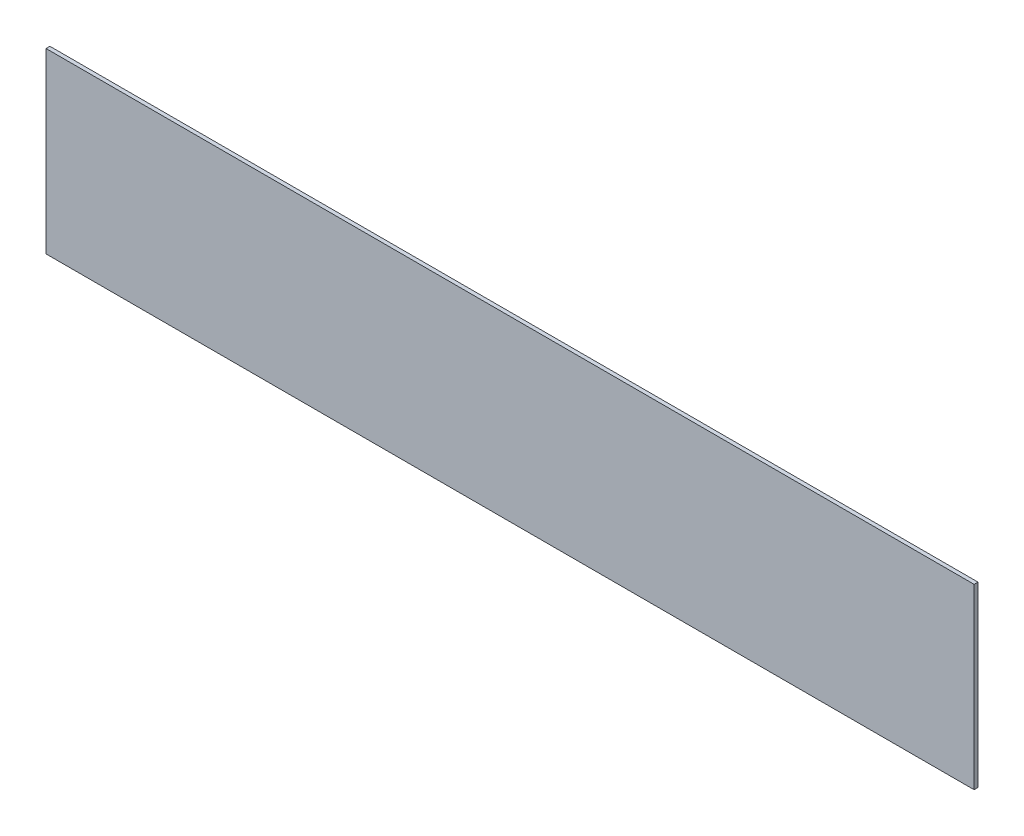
from build123d import *

# Parameters (mm, degrees)
ESQUISSE1_W             = 120
ESQUISSE1_H             = 23
BOSS_EXTRU_1_DEPTH      = 0.5
ESQUISSE3_W             = 0.889033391
ESQUISSE3_H             = 4.622973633
ENL_V_MAT_EXTRU_1_DEPTH = 0.3


with BuildPart() as part:
    # Esquisse1 → Boss.-Extru.1 (new body)
    with BuildSketch(Plane(origin=(0, 0, 0), x_dir=(-1, 0, 0), z_dir=(0, 0, -1))):
        with Locations((-60, -11.5)):
            Rectangle(ESQUISSE1_W, ESQUISSE1_H)
    extrude(amount=-BOSS_EXTRU_1_DEPTH)

    # Esquisse3 → Enl_v. mat.-Extru.1 (cut)
    # profile 1 of 15: a face of its own
    with BuildSketch(Plane(origin=(0, 0, 0), x_dir=(-1, 0, 0), z_dir=(0, 0, -1))):
        with BuildLine():
            Line((-107.200895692, -6.103883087), (-106.311862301, -6.400227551))
            add(Edge.make_bspline(
                [(-106.311862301, -6.400227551), (-106.329930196, -6.458519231), (-106.365312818, -6.572672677), (-106.430281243, -6.736281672), (-106.50457163, -6.887905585), (-106.585512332, -7.029319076), (-106.678136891, -7.156868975), (-106.777259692, -7.274778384), (-106.885828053, -7.380563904), (-107.003306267, -7.474451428), (-107.128563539, -7.557478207), (-107.263054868, -7.627668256), (-107.404773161, -7.688121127), (-107.55515552, -7.737100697), (-107.713203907, -7.776325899), (-107.879659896, -7.802234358), (-108.053744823, -7.819801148), (-108.172612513, -7.821705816), (-108.233470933, -7.822680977)],
                knots=[0, 0, 0, 0, 1.126640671, 2.206316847, 3.246446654, 4.24268115, 5.210795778, 6.153057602, 7.084219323, 8.004711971, 8.926421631, 9.854560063, 10.802134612, 11.768317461, 12.772025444, 13.805668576, 14.876536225, 16, 16, 16, 16], degree=3))
            add(Edge.make_bspline(
                [(-108.233470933, -7.822680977), (-108.308588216, -7.821127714), (-108.456346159, -7.8180724), (-108.672428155, -7.787316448), (-108.878344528, -7.739329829), (-109.074389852, -7.67289319), (-109.259255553, -7.58489803), (-109.434628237, -7.478963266), (-109.599231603, -7.352938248), (-109.752488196, -7.208946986), (-109.891725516, -7.048088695), (-110.012129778, -6.871232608), (-110.115011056, -6.680870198), (-110.198165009, -6.476093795), (-110.263185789, -6.257113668), (-110.308732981, -6.024232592), (-110.337233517, -5.77737721), (-110.34048056, -5.608203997), (-110.342147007, -5.521381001)],
                knots=[0, 0, 0, 0, 1.025049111, 2.016302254, 2.973197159, 3.90886983, 4.83646737, 5.763135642, 6.70136783, 7.661478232, 8.629732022, 9.600038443, 10.576877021, 11.5787097, 12.612181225, 13.690866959, 14.814907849, 16, 16, 16, 16], degree=3))
            add(Edge.make_bspline(
                [(-110.342147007, -5.521381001), (-110.340488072, -5.429928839), (-110.337251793, -5.251522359), (-110.308697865, -4.992134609), (-110.264369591, -4.747676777), (-110.199238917, -4.519664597), (-110.117306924, -4.3064934), (-110.014300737, -4.110279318), (-109.895097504, -3.928406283), (-109.75649211, -3.764207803), (-109.602537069, -3.618421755), (-109.4375552, -3.489507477), (-109.260007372, -3.38135764), (-109.070865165, -3.292918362), (-108.869874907, -3.224479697), (-108.657432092, -3.175198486), (-108.433362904, -3.146513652), (-108.280165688, -3.142491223), (-108.201984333, -3.140438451)],
                knots=[0, 0, 0, 0, 1.212648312, 2.365655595, 3.457000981, 4.504219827, 5.506356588, 6.480637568, 7.437950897, 8.385265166, 9.323599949, 10.245787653, 11.157260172, 12.074946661, 13.00980897, 13.968233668, 14.963125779, 16, 16, 16, 16], degree=3))
            add(Edge.make_bspline(
                [(-108.201984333, -3.140438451), (-108.133705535, -3.1421589), (-107.999835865, -3.145532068), (-107.803797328, -3.168449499), (-107.618007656, -3.208668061), (-107.441462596, -3.262954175), (-107.27516714, -3.334597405), (-107.11882337, -3.422144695), (-106.971893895, -3.525132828), (-106.883365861, -3.605578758), (-106.838799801, -3.646076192)],
                knots=[0, 0, 0, 0, 1.098510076, 2.153775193, 3.169777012, 4.153122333, 5.120892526, 6.076995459, 7.031936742, 8, 8, 8, 8], degree=3))
            add(Edge.make_bspline(
                [(-106.838799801, -3.646076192), (-106.812969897, -3.671845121), (-106.760703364, -3.723988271), (-106.690912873, -3.812020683), (-106.624742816, -3.90678759), (-106.563243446, -4.009905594), (-106.508358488, -4.122153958), (-106.457446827, -4.241808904), (-106.41057437, -4.369331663), (-106.384507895, -4.458079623), (-106.371131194, -4.503622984)],
                knots=[0, 0, 0, 0, 0.885292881, 1.791380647, 2.722937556, 3.69093542, 4.703306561, 5.754477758, 6.847650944, 8, 8, 8, 8], degree=3))
            Line((-106.371131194, -4.503622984), (-107.260164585, -4.681429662))
            add(Edge.make_bspline(
                [(-107.260164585, -4.681429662), (-107.267721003, -4.652269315), (-107.282605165, -4.594831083), (-107.31272124, -4.512295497), (-107.347266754, -4.433976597), (-107.390082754, -4.361792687), (-107.435564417, -4.292532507), (-107.489412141, -4.229271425), (-107.548187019, -4.170351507), (-107.612312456, -4.116384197), (-107.681023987, -4.068459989), (-107.752998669, -4.02537911), (-107.829544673, -3.990211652), (-107.909643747, -3.961761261), (-107.992976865, -3.937907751), (-108.080285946, -3.923172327), (-108.170821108, -3.911860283), (-108.232505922, -3.911247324), (-108.264031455, -3.910934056)],
                knots=[0, 0, 0, 0, 1.051226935, 2.070641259, 3.064374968, 4.034983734, 4.997599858, 5.953980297, 6.92954377, 7.901109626, 8.875958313, 9.851998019, 10.826131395, 11.811470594, 12.818270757, 13.847890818, 14.900111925, 16, 16, 16, 16], degree=3))
            add(Edge.make_bspline(
                [(-108.264031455, -3.910934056), (-108.30732593, -3.911808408), (-108.391823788, -3.913514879), (-108.515330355, -3.932540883), (-108.633046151, -3.959093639), (-108.744496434, -3.999639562), (-108.848991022, -4.051497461), (-108.947717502, -4.114536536), (-109.04013401, -4.188486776), (-109.126271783, -4.274224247), (-109.203568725, -4.373299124), (-109.271523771, -4.485915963), (-109.327898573, -4.613353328), (-109.373665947, -4.754360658), (-109.409690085, -4.909273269), (-109.435414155, -5.078289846), (-109.449640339, -5.261526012), (-109.451930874, -5.388310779), (-109.453113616, -5.45377742)],
                knots=[0, 0, 0, 0, 0.938194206, 1.831074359, 2.704771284, 3.551924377, 4.396294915, 5.230222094, 6.087631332, 6.958733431, 7.860107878, 8.806247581, 9.804197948, 10.875520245, 12.017191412, 13.250061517, 14.580040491, 16, 16, 16, 16], degree=3))
            add(Edge.make_bspline(
                [(-109.453113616, -5.45377742), (-109.45194252, -5.523255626), (-109.449685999, -5.657129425), (-109.435462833, -5.850229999), (-109.40957427, -6.027831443), (-109.374028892, -6.190248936), (-109.32803088, -6.337382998), (-109.271751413, -6.468979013), (-109.204845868, -6.585191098), (-109.127418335, -6.685941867), (-109.041426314, -6.772486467), (-108.949198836, -6.846895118), (-108.851280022, -6.910514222), (-108.747080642, -6.962855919), (-108.636204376, -7.00245183), (-108.519562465, -7.031167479), (-108.39672693, -7.049422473), (-108.312561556, -7.051251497), (-108.269587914, -7.052185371)],
                knots=[0, 0, 0, 0, 1.475208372, 2.842499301, 4.107722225, 5.282836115, 6.369007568, 7.375918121, 8.315702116, 9.208439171, 10.065831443, 10.90006451, 11.71996243, 12.54067204, 13.369972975, 14.214060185, 15.088124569, 16, 16, 16, 16], degree=3))
            add(Edge.make_bspline(
                [(-108.269587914, -7.052185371), (-108.237771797, -7.051391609), (-108.175210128, -7.049830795), (-108.082739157, -7.039924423), (-107.993985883, -7.02101954), (-107.908515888, -6.996021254), (-107.825997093, -6.96465578), (-107.74768818, -6.924420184), (-107.672048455, -6.878175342), (-107.600647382, -6.82397993), (-107.532528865, -6.763135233), (-107.470400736, -6.692813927), (-107.412771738, -6.614705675), (-107.360372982, -6.528288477), (-107.311453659, -6.434302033), (-107.26983285, -6.331281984), (-107.231059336, -6.220893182), (-107.211125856, -6.143567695), (-107.200895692, -6.103883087)],
                knots=[0, 0, 0, 0, 0.980177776, 1.927374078, 2.859849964, 3.771585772, 4.668674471, 5.574490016, 6.479656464, 7.396337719, 8.332153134, 9.288470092, 10.28125149, 11.318486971, 12.398724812, 13.541284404, 14.738150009, 16, 16, 16, 16], degree=3))
        make_face()
    # profile 2 of 15: a face of its own
    with BuildSketch(Plane(origin=(0, 0, 0), x_dir=(-1, 0, 0), z_dir=(0, 0, -1))):
        Polygon((-105.541366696, -7.822680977), (-105.541366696, -3.199707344), (-104.652333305, -3.199707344), (-104.652333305, -5.037043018), (-102.755728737, -5.037043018), (-102.755728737, -3.199707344), (-101.866695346, -3.199707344), (-101.866695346, -7.822680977), (-102.755728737, -7.822680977), (-102.755728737, -5.807538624), (-104.652333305, -5.807538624), (-104.652333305, -7.822680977), align=None)
    # profile 3 of 15: a face of its own
    with BuildSketch(Plane(origin=(0, 0, 0), x_dir=(-1, 0, 0), z_dir=(0, 0, -1))):
        Polygon((-96.94737725, -7.822680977), (-97.890123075, -7.822680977), (-98.28000126, -6.755840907), (-100.054363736, -6.755840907), (-100.444241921, -7.822680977), (-101.392544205, -7.822680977), (-99.645037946, -3.199707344), (-98.703218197, -3.199707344), align=None)
        Polygon((-98.562454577, -5.985345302), (-99.169960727, -4.325816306), (-99.775614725, -5.985345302), align=None, mode=Mode.SUBTRACT)
    # profile 4 of 15: a face of its own
    with BuildSketch(Plane(origin=(0, 0, 0), x_dir=(-1, 0, 0), z_dir=(0, 0, -1))):
        with BuildLine():
            Line((-96.473226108, -7.822680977), (-96.473226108, -3.199707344))
            Line((-96.473226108, -3.199707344), (-94.533095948, -3.199707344))
            add(Edge.make_bspline(
                [(-94.533095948, -3.199707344), (-94.474133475, -3.200070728), (-94.360501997, -3.200771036), (-94.196168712, -3.205877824), (-94.044616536, -3.216576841), (-93.90517318, -3.228693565), (-93.778508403, -3.246322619), (-93.664121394, -3.267442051), (-93.562204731, -3.291916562), (-93.471271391, -3.321228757), (-93.388358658, -3.354777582), (-93.311121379, -3.394710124), (-93.238710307, -3.441496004), (-93.17001328, -3.493522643), (-93.104739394, -3.55086998), (-93.044678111, -3.61505571), (-92.988783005, -3.685124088), (-92.937099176, -3.760492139), (-92.891568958, -3.840827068), (-92.849966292, -3.923548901), (-92.816100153, -4.009537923), (-92.78812703, -4.098389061), (-92.765781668, -4.189909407), (-92.750272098, -4.28433164), (-92.740589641, -4.381484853), (-92.739725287, -4.447109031), (-92.739285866, -4.480471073)],
                knots=[0, 0, 0, 0, 1.675828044, 3.229627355, 4.67171229, 5.993455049, 7.206927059, 8.304770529, 9.29850117, 10.183580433, 11.017754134, 11.837875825, 12.650738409, 13.464925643, 14.285328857, 15.117007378, 15.959673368, 16.830859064, 17.711229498, 18.58228265, 19.460420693, 20.334473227, 21.228207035, 22.135446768, 23.052097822, 24, 24, 24, 24], degree=3))
            add(Edge.make_bspline(
                [(-92.739285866, -4.480471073), (-92.740100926, -4.522497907), (-92.741693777, -4.604629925), (-92.756352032, -4.725009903), (-92.778123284, -4.840024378), (-92.809158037, -4.949832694), (-92.85183019, -5.053143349), (-92.901367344, -5.151403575), (-92.960448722, -5.244280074), (-93.02867293, -5.330852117), (-93.10597889, -5.411196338), (-93.192705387, -5.483659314), (-93.288233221, -5.548524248), (-93.393140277, -5.605417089), (-93.506696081, -5.654054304), (-93.629393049, -5.694976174), (-93.760675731, -5.728282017), (-93.851995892, -5.743953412), (-93.89873358, -5.751974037)],
                knots=[0, 0, 0, 0, 1.05911256, 2.069797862, 3.05271628, 4.008392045, 4.940519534, 5.866323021, 6.779546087, 7.71056835, 8.640711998, 9.585328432, 10.554502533, 11.547017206, 12.589327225, 13.664782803, 14.804835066, 16, 16, 16, 16], degree=3))
            add(Edge.make_bspline(
                [(-93.89873358, -5.751974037), (-93.853532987, -5.781910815), (-93.765069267, -5.840501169), (-93.642673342, -5.937000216), (-93.532790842, -6.038283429), (-93.449593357, -6.128350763), (-93.385664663, -6.207555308), (-93.334191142, -6.276828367), (-93.278668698, -6.356551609), (-93.219641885, -6.44676823), (-93.15536572, -6.546680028), (-93.08823075, -6.657816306), (-93.016832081, -6.779093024), (-92.968827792, -6.863810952), (-92.943948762, -6.907717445)],
                knots=[0, 0, 0, 0, 1.285445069, 2.515791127, 3.691898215, 4.826622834, 5.420063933, 6.105349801, 6.873086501, 7.723915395, 8.66222816, 9.690593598, 10.803111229, 12, 12, 12, 12], degree=3))
            Line((-92.943948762, -6.907717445), (-92.38367251, -7.822680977))
            Line((-92.38367251, -7.822680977), (-93.422730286, -7.822680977))
            Line((-93.422730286, -7.822680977), (-94.080244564, -6.77343636))
            add(Edge.make_bspline(
                [(-94.080244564, -6.77343636), (-94.11044154, -6.73141487), (-94.168093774, -6.651187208), (-94.251318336, -6.537181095), (-94.327461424, -6.435695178), (-94.394496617, -6.345259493), (-94.455815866, -6.268438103), (-94.509557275, -6.203892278), (-94.554626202, -6.150236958), (-94.605621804, -6.097035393), (-94.664949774, -6.042359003), (-94.738393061, -5.98934713), (-94.813812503, -5.947086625), (-94.894618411, -5.914840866), (-94.988068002, -5.892356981), (-95.10040921, -5.878031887), (-95.235174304, -5.867462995), (-95.332582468, -5.867037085), (-95.385086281, -5.866807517)],
                knots=[0, 0, 0, 0, 1.465447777, 2.797841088, 3.997266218, 5.05856206, 5.985598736, 6.780315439, 7.437430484, 7.969193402, 8.866571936, 9.718200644, 10.52825214, 11.309096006, 12.174169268, 13.242355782, 14.513606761, 16, 16, 16, 16], degree=3))
            Line((-95.385086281, -5.866807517), (-95.584192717, -5.866807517))
            Line((-95.584192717, -5.866807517), (-95.584192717, -7.822680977))
            Line((-95.584192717, -7.822680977), (-96.473226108, -7.822680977))
        make_face()
        with BuildLine():
            Line((-95.584192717, -5.096311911), (-94.868335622, -5.096311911))
            add(Edge.make_bspline(
                [(-94.868335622, -5.096311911), (-94.81307706, -5.096193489), (-94.70780016, -5.095967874), (-94.558094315, -5.092699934), (-94.424356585, -5.089926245), (-94.307387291, -5.082957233), (-94.206663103, -5.076050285), (-94.122588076, -5.067073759), (-94.054453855, -5.056463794), (-93.98639922, -5.039968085), (-93.91668815, -5.011227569), (-93.842389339, -4.970292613), (-93.778887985, -4.917188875), (-93.723881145, -4.855795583), (-93.681918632, -4.783622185), (-93.649052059, -4.703884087), (-93.632388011, -4.614809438), (-93.629703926, -4.553069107), (-93.628319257, -4.521218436)],
                knots=[0, 0, 0, 0, 1.697953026, 3.23488743, 4.60134403, 5.807846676, 6.835100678, 7.703488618, 8.405232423, 8.952775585, 9.851109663, 10.713519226, 11.549115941, 12.382556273, 13.233359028, 14.101746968, 15.020727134, 16, 16, 16, 16], degree=3))
            add(Edge.make_bspline(
                [(-93.628319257, -4.521218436), (-93.629894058, -4.485586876), (-93.632932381, -4.416841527), (-93.65689303, -4.31901624), (-93.698715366, -4.232601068), (-93.756153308, -4.157453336), (-93.828257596, -4.093997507), (-93.914141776, -4.043627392), (-94.01316779, -4.006113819), (-94.084591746, -3.99226013), (-94.121918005, -3.985020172)],
                knots=[0, 0, 0, 0, 1.062977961, 2.050844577, 2.982300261, 3.90936959, 4.856017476, 5.831122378, 6.86654153, 8, 8, 8, 8], degree=3))
            add(Edge.make_bspline(
                [(-94.121918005, -3.985020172), (-94.134256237, -3.983664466), (-94.163500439, -3.980451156), (-94.215142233, -3.978387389), (-94.281172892, -3.975215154), (-94.362391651, -3.973918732), (-94.458072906, -3.971646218), (-94.568597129, -3.971228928), (-94.693613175, -3.969895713), (-94.781901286, -3.970096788), (-94.828514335, -3.970202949)],
                knots=[0, 0, 0, 0, 0.42127143, 0.998501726, 1.753681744, 2.66564073, 3.755712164, 5.002818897, 6.417592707, 8, 8, 8, 8], degree=3))
            Line((-94.828514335, -3.970202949), (-95.584192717, -3.970202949))
            Line((-95.584192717, -3.970202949), (-95.584192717, -5.096311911))
        make_face(mode=Mode.SUBTRACT)
    # profile 5 of 15: a face of its own
    with BuildSketch(Plane(origin=(0, 0, 0), x_dir=(-1, 0, 0), z_dir=(0, 0, -1))):
        with BuildLine():
            Line((-89.77584123, -6.103883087), (-89.77584123, -5.333387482))
            Line((-89.77584123, -5.333387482), (-87.760698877, -5.333387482))
            Line((-87.760698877, -5.333387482), (-87.760698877, -7.190170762))
            add(Edge.make_bspline(
                [(-87.760698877, -7.190170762), (-87.786059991, -7.213009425), (-87.837903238, -7.259696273), (-87.922502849, -7.325516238), (-88.015589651, -7.388440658), (-88.116972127, -7.449379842), (-88.22575307, -7.509524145), (-88.342813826, -7.567158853), (-88.468452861, -7.621222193), (-88.644338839, -7.693001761), (-88.872387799, -7.767803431), (-89.15039573, -7.834054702), (-89.430773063, -7.874400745), (-89.618280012, -7.879435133), (-89.711941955, -7.881949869)],
                knots=[0, 0, 0, 0, 0.58168568, 1.189083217, 1.825470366, 2.496035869, 3.204984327, 3.943979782, 4.719294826, 5.536247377, 7.182083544, 8.80443077, 10.4037753, 12, 12, 12, 12], degree=3))
            add(Edge.make_bspline(
                [(-89.711941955, -7.881949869), (-89.770619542, -7.881068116), (-89.886290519, -7.879329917), (-90.057047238, -7.865339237), (-90.221896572, -7.84140125), (-90.38097286, -7.807503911), (-90.534814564, -7.766641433), (-90.682780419, -7.714515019), (-90.824345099, -7.651941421), (-90.960791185, -7.58221607), (-91.08957499, -7.502130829), (-91.210820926, -7.414524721), (-91.323651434, -7.318635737), (-91.427662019, -7.214270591), (-91.52424554, -7.102148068), (-91.612275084, -6.981733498), (-91.691218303, -6.852887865), (-91.762049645, -6.717227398), (-91.825064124, -6.575945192), (-91.878237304, -6.430153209), (-91.924854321, -6.28196819), (-91.963168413, -6.130869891), (-91.99130824, -5.976367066), (-92.013183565, -5.81917459), (-92.024932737, -5.658310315), (-92.027009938, -5.550105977), (-92.028059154, -5.495450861)],
                knots=[0, 0, 0, 0, 1.124918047, 2.217548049, 3.282233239, 4.316494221, 5.334437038, 6.332151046, 7.320712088, 8.300141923, 9.267552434, 10.225301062, 11.165776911, 12.103230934, 13.047553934, 14.000517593, 14.959782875, 15.941944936, 16.932894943, 17.923491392, 18.915624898, 19.910402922, 20.909870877, 21.92519501, 22.95199481, 24, 24, 24, 24], degree=3))
            add(Edge.make_bspline(
                [(-92.028059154, -5.495450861), (-92.027208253, -5.436460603), (-92.02553076, -5.320165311), (-92.011073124, -5.148282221), (-91.988622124, -4.981435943), (-91.954576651, -4.819929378), (-91.913156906, -4.663010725), (-91.862606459, -4.510783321), (-91.800671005, -4.364375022), (-91.731773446, -4.222533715), (-91.65334279, -4.08722092), (-91.56472056, -3.960172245), (-91.468529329, -3.840106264), (-91.36286828, -3.728930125), (-91.2481095, -3.626698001), (-91.125419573, -3.532279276), (-90.995092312, -3.444046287), (-90.901813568, -3.394296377), (-90.854720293, -3.369179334)],
                knots=[0, 0, 0, 0, 1.105010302, 2.178452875, 3.229459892, 4.257086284, 5.268538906, 6.268935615, 7.259234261, 8.24469117, 9.221745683, 10.185929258, 11.144249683, 12.101504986, 13.055838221, 14.020611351, 15.000673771, 16, 16, 16, 16], degree=3))
            add(Edge.make_bspline(
                [(-90.854720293, -3.369179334), (-90.817346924, -3.350622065), (-90.741438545, -3.31293073), (-90.620667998, -3.267929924), (-90.494358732, -3.226983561), (-90.360603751, -3.196432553), (-90.220311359, -3.171332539), (-90.07354373, -3.152601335), (-89.919828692, -3.142764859), (-89.815366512, -3.141225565), (-89.761950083, -3.140438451)],
                knots=[0, 0, 0, 0, 0.887969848, 1.803539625, 2.741143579, 3.713741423, 4.722068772, 5.775476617, 6.8624965, 8, 8, 8, 8], degree=3))
            add(Edge.make_bspline(
                [(-89.761950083, -3.140438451), (-89.693079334, -3.141464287), (-89.55913846, -3.143459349), (-89.363862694, -3.160083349), (-89.18008268, -3.188734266), (-89.007542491, -3.228194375), (-88.846613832, -3.278929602), (-88.697573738, -3.341302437), (-88.559507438, -3.414057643), (-88.434414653, -3.500111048), (-88.319753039, -3.594994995), (-88.215821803, -3.698824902), (-88.122579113, -3.81175456), (-88.039963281, -3.933215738), (-87.968624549, -4.063710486), (-87.907286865, -4.202048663), (-87.856798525, -4.349280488), (-87.83239863, -4.451530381), (-87.81996777, -4.503622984)],
                knots=[0, 0, 0, 0, 1.271135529, 2.472123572, 3.614091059, 4.701890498, 5.736279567, 6.724681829, 7.680621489, 8.611506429, 9.52200816, 10.424540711, 11.318996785, 12.221421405, 13.131851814, 14.060431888, 15.011860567, 16, 16, 16, 16], degree=3))
            Line((-87.81996777, -4.503622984), (-88.709001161, -4.681429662))
            add(Edge.make_bspline(
                [(-88.709001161, -4.681429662), (-88.717804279, -4.652256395), (-88.735172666, -4.594698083), (-88.768842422, -4.512076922), (-88.807622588, -4.434407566), (-88.851606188, -4.361127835), (-88.901236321, -4.292688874), (-88.957712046, -4.229828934), (-89.017480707, -4.169680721), (-89.084445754, -4.116430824), (-89.155825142, -4.068426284), (-89.230814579, -4.025138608), (-89.311108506, -3.99003351), (-89.395582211, -3.96178764), (-89.483822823, -3.937799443), (-89.576981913, -3.923046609), (-89.674013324, -3.911920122), (-89.740306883, -3.911266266), (-89.773989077, -3.910934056)],
                knots=[0, 0, 0, 0, 1.027736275, 2.027704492, 3.005900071, 3.954421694, 4.908588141, 5.853155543, 6.803277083, 7.766271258, 8.734041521, 9.704274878, 10.683578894, 11.68490234, 12.708089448, 13.76461009, 14.864251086, 16, 16, 16, 16], degree=3))
            add(Edge.make_bspline(
                [(-89.773989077, -3.910934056), (-89.824968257, -3.912294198), (-89.924458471, -3.914948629), (-90.069700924, -3.932269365), (-90.206723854, -3.963084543), (-90.335885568, -4.005588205), (-90.457422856, -4.060144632), (-90.569693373, -4.128788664), (-90.675492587, -4.207458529), (-90.771809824, -4.299790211), (-90.859158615, -4.403320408), (-90.934774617, -4.519284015), (-90.997724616, -4.647306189), (-91.049284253, -4.786744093), (-91.090336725, -4.937603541), (-91.118186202, -5.100418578), (-91.136382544, -5.274939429), (-91.138126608, -5.395385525), (-91.139025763, -5.457481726)],
                knots=[0, 0, 0, 0, 1.043810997, 2.037086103, 2.989314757, 3.91471467, 4.817033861, 5.710208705, 6.603920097, 7.511448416, 8.435617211, 9.371747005, 10.338444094, 11.350425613, 12.411431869, 13.5347293, 14.729025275, 16, 16, 16, 16], degree=3))
            add(Edge.make_bspline(
                [(-91.139025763, -5.457481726), (-91.138088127, -5.524199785), (-91.136265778, -5.653870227), (-91.118546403, -5.841754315), (-91.089397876, -6.016802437), (-91.047589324, -6.178793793), (-90.994981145, -6.328303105), (-90.931743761, -6.465807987), (-90.853701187, -6.588756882), (-90.765792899, -6.699614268), (-90.667538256, -6.796480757), (-90.561692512, -6.880931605), (-90.448844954, -6.952500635), (-90.327954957, -7.010058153), (-90.200547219, -7.05587542), (-90.065450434, -7.087996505), (-89.923066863, -7.10794894), (-89.825607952, -7.110269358), (-89.77584123, -7.111454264)],
                knots=[0, 0, 0, 0, 1.318042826, 2.561693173, 3.724929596, 4.821196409, 5.862977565, 6.853497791, 7.804600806, 8.73339865, 9.643480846, 10.524649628, 11.404635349, 12.277659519, 13.165160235, 14.075017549, 15.017020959, 16, 16, 16, 16], degree=3))
            add(Edge.make_bspline(
                [(-89.77584123, -7.111454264), (-89.725434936, -7.110053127), (-89.624140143, -7.107237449), (-89.472419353, -7.08337743), (-89.320104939, -7.048266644), (-89.170771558, -6.995301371), (-89.025743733, -6.934550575), (-88.890344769, -6.864536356), (-88.763547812, -6.791555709), (-88.687201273, -6.734674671), (-88.649732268, -6.706758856)],
                knots=[0, 0, 0, 0, 0.993821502, 1.997150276, 3.023717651, 4.073291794, 5.118404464, 6.123376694, 7.078999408, 8, 8, 8, 8], degree=3))
            Line((-88.649732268, -6.706758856), (-88.649732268, -6.103883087))
            Line((-88.649732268, -6.103883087), (-89.77584123, -6.103883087))
        make_face()
    # profile 6 of 15: a face of its own
    with BuildSketch(Plane(origin=(0, 0, 0), x_dir=(-1, 0, 0), z_dir=(0, 0, -1))):
        Polygon((-86.871665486, -7.822680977), (-86.871665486, -3.199707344), (-83.434069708, -3.199707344), (-83.434069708, -3.970202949), (-85.982632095, -3.970202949), (-85.982632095, -4.977774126), (-83.611876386, -4.977774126), (-83.611876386, -5.748269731), (-85.982632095, -5.748269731), (-85.982632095, -7.052185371), (-83.374800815, -7.052185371), (-83.374800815, -7.822680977), align=None)
    # profile 7 of 15: a face of its own
    with BuildSketch(Plane(origin=(0, 0, 0), x_dir=(-1, 0, 0), z_dir=(0, 0, -1))):
        Polygon((-104.074649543, -18.191514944), (-104.074649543, -13.568541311), (-102.57070139, -13.568541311), (-101.792797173, -16.72183162), (-101.014892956, -13.568541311), (-99.510944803, -13.568541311), (-99.510944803, -18.191514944), (-100.399978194, -18.191514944), (-100.42961264, -14.5520345), (-101.297346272, -18.191514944), (-102.288248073, -18.191514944), (-103.155981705, -14.5520345), (-103.185616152, -18.191514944), align=None)
    # profile 8 of 15: a face of its own
    with BuildSketch(Plane(origin=(0, 0, 0), x_dir=(-1, 0, 0), z_dir=(0, 0, -1))):
        Polygon((-94.650895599, -18.191514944), (-95.593641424, -18.191514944), (-95.983519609, -17.124674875), (-97.757882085, -17.124674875), (-98.14776027, -18.191514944), (-99.096062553, -18.191514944), (-97.348556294, -13.568541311), (-96.406736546, -13.568541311), align=None)
        Polygon((-96.265972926, -16.35417927), (-96.873479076, -14.694650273), (-97.479133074, -16.35417927), align=None, mode=Mode.SUBTRACT)
    # profile 9 of 15: a face of its own
    with BuildSketch(Plane(origin=(0, 0, 0), x_dir=(-1, 0, 0), z_dir=(0, 0, -1))):
        Polygon((-94.621261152, -18.191514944), (-93.036744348, -15.742968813), (-94.443454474, -13.568541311), (-93.404396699, -13.568541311), (-92.517215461, -14.940060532), (-91.630034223, -13.568541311), (-90.590976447, -13.568541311), (-91.997686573, -15.742968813), (-90.413169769, -18.191514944), (-91.452227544, -18.191514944), (-92.517215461, -16.545877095), (-93.582203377, -18.191514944), align=None)
    # profile 10 of 15: a face of its own
    with BuildSketch(Plane(origin=(0, 0, 0), x_dir=(-1, 0, 0), z_dir=(0, 0, -1))):
        with Locations((-89.524136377, -15.880028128)):
            Rectangle(ESQUISSE3_W, ESQUISSE3_H)
    # profile 11 of 15: a face of its own
    with BuildSketch(Plane(origin=(0, 0, 0), x_dir=(-1, 0, 0), z_dir=(0, 0, -1))):
        with BuildLine():
            Line((-60.354818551, -17.106404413), (-62.72557426, -17.106404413))
            Line((-62.72557426, -17.106404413), (-62.72557426, -8.329669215))
            add(Edge.make_bspline(
                [(-62.72557426, -8.329669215), (-62.833029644, -8.438756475), (-63.046482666, -8.655451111), (-63.387400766, -8.957711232), (-63.741325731, -9.238892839), (-64.111759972, -9.496325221), (-64.493860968, -9.733676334), (-64.891533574, -9.949073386), (-65.301895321, -10.145496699), (-65.586170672, -10.255266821), (-65.728531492, -10.310238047)],
                knots=[0, 0, 0, 0, 1.012567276, 2.011397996, 3.011400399, 4.000747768, 4.993445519, 5.985067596, 6.990952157, 8, 8, 8, 8], degree=3))
            Line((-65.728531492, -10.310238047), (-65.728531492, -7.939482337))
            add(Edge.make_bspline(
                [(-65.728531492, -7.939482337), (-65.570646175, -7.880282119), (-65.240204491, -7.756380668), (-64.75258369, -7.492836), (-64.243617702, -7.166541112), (-63.816057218, -6.846521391), (-63.47659177, -6.561998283), (-63.23933123, -6.33328635), (-63.019495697, -6.099073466), (-62.825348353, -5.851800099), (-62.651792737, -5.59646557), (-62.498014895, -5.333487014), (-62.362655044, -5.062033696), (-62.291795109, -4.872999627), (-62.256362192, -4.778474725)],
                knots=[0, 0, 0, 0, 1.253673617, 2.623841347, 4.114270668, 5.751233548, 6.594491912, 7.409089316, 8.202422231, 8.983165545, 9.746111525, 10.498431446, 11.249153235, 12, 12, 12, 12], degree=3))
            Line((-62.256362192, -4.778474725), (-60.354818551, -4.778474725))
            Line((-60.354818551, -4.778474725), (-60.354818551, -17.106404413))
        make_face()
    # profile 12 of 15: a face of its own
    with BuildSketch(Plane(origin=(0, 0, 0), x_dir=(-1, 0, 0), z_dir=(0, 0, -1))):
        with BuildLine():
            add(Edge.make_bspline(
                [(-52.847425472, -4.778474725), (-52.700682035, -4.782014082), (-52.414989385, -4.788904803), (-51.998703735, -4.849944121), (-51.606750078, -4.947817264), (-51.239157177, -5.086167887), (-50.896269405, -5.265824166), (-50.580370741, -5.487553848), (-50.284558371, -5.744710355), (-50.113737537, -5.944268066), (-50.027213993, -6.045347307)],
                knots=[0, 0, 0, 0, 1.098584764, 2.138818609, 3.143716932, 4.11936356, 5.073598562, 6.034819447, 7.004603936, 8, 8, 8, 8], degree=3))
            add(Edge.make_bspline(
                [(-50.027213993, -6.045347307), (-49.977721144, -6.109721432), (-49.876714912, -6.241097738), (-49.740682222, -6.453387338), (-49.609905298, -6.678579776), (-49.495749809, -6.922095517), (-49.386440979, -7.179708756), (-49.285142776, -7.452006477), (-49.197188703, -7.7412385), (-49.114429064, -8.043706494), (-49.04698755, -8.364134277), (-48.984665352, -8.699062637), (-48.932997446, -9.050009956), (-48.892254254, -9.4158534), (-48.855866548, -9.796036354), (-48.835927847, -10.192373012), (-48.8196023, -10.603978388), (-48.817970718, -10.883975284), (-48.817140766, -11.026403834)],
                knots=[0, 0, 0, 0, 0.746761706, 1.524009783, 2.317797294, 3.140957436, 3.996208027, 4.892396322, 5.812273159, 6.776774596, 7.776522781, 8.823794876, 9.910947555, 11.039215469, 12.21036455, 13.424061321, 14.689674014, 16, 16, 16, 16], degree=3))
            add(Edge.make_bspline(
                [(-48.817140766, -11.026403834), (-48.817958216, -11.168832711), (-48.8195605, -11.448007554), (-48.83598871, -11.858787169), (-48.855884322, -12.25429748), (-48.892169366, -12.63450074), (-48.933302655, -13.000271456), (-48.983493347, -13.350825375), (-49.05050538, -13.68421473), (-49.116885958, -14.004131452), (-49.199160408, -14.30788727), (-49.291066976, -14.596600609), (-49.38829374, -14.872292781), (-49.500144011, -15.130237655), (-49.618395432, -15.374054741), (-49.747226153, -15.601545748), (-49.884777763, -15.815150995), (-49.986761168, -15.947220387), (-50.037092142, -16.012399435)],
                knots=[0, 0, 0, 0, 1.308387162, 2.564569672, 3.776470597, 4.945886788, 6.07248526, 7.158029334, 8.197718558, 9.195987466, 10.159061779, 11.087054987, 11.979325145, 12.84323098, 13.668471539, 14.467659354, 15.243757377, 16, 16, 16, 16], degree=3))
            add(Edge.make_bspline(
                [(-50.037092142, -16.012399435), (-50.12282405, -16.112612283), (-50.292062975, -16.310437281), (-50.584601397, -16.56546116), (-50.899976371, -16.782605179), (-51.2422602, -16.958691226), (-51.608056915, -17.097996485), (-52.000651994, -17.192746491), (-52.415800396, -17.253910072), (-52.701498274, -17.260889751), (-52.847425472, -17.264454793)],
                knots=[0, 0, 0, 0, 0.991631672, 1.957528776, 2.911425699, 3.867574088, 4.848108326, 5.850523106, 6.902101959, 8, 8, 8, 8], degree=3))
            add(Edge.make_bspline(
                [(-52.847425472, -17.264454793), (-52.995020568, -17.260207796), (-53.284240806, -17.251885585), (-53.70651489, -17.185913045), (-54.107905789, -17.080225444), (-54.486972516, -16.929331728), (-54.843172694, -16.733784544), (-55.1792891, -16.499377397), (-55.488009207, -16.215496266), (-55.729703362, -15.951218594), (-55.906527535, -15.712424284), (-56.03124052, -15.514407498), (-56.151762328, -15.302521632), (-56.255787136, -15.070142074), (-56.358416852, -14.824141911), (-56.449314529, -14.559219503), (-56.529509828, -14.277652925), (-56.604808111, -13.980727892), (-56.667595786, -13.666399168), (-56.72535123, -13.335594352), (-56.770865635, -12.986906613), (-56.811218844, -12.622278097), (-56.839629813, -12.240848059), (-56.862703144, -11.843240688), (-56.87427283, -11.428183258), (-56.876549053, -11.145770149), (-56.877710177, -11.001708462)],
                knots=[0, 0, 0, 0, 1.257818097, 2.464759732, 3.634271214, 4.790227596, 5.933394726, 7.09190477, 8.274482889, 9.50191983, 10.139172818, 10.805000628, 11.49619854, 12.215266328, 12.973768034, 13.768328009, 14.601232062, 15.469317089, 16.379095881, 17.333267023, 18.331755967, 19.376479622, 20.460535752, 21.592206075, 22.771760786, 24, 24, 24, 24], degree=3))
            add(Edge.make_bspline(
                [(-56.877710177, -11.001708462), (-56.876899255, -10.860102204), (-56.875309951, -10.582572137), (-56.85876194, -10.173446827), (-56.839129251, -9.779560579), (-56.802449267, -9.400223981), (-56.7618929, -9.03601514), (-56.710772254, -8.68645388), (-56.645426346, -8.353348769), (-56.574278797, -8.035370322), (-56.4962348, -7.731392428), (-56.403473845, -7.443956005), (-56.307218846, -7.168713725), (-56.194061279, -6.912144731), (-56.076535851, -6.668840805), (-55.947604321, -6.441392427), (-55.810078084, -6.22777645), (-55.708091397, -6.095708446), (-55.657758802, -6.030530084)],
                knots=[0, 0, 0, 0, 1.304469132, 2.556591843, 3.77188756, 4.93702727, 6.066781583, 7.147865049, 8.190466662, 9.19316792, 10.149665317, 11.080258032, 11.975027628, 12.834388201, 13.661940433, 14.463366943, 15.241638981, 16, 16, 16, 16], degree=3))
            add(Edge.make_bspline(
                [(-55.657758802, -6.030530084), (-55.572031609, -5.930307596), (-55.402801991, -5.732463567), (-55.110195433, -5.477579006), (-54.794471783, -5.259497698), (-54.451186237, -5.085519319), (-54.086228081, -4.944304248), (-53.694146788, -4.85031033), (-53.279064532, -4.788985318), (-52.993357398, -4.782028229), (-52.847425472, -4.778474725)],
                knots=[0, 0, 0, 0, 0.991667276, 1.957599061, 2.911530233, 3.873218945, 4.847995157, 5.850445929, 6.902062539, 8, 8, 8, 8], degree=3))
        make_face()
        with BuildLine():
            add(Edge.make_bspline(
                [(-52.847425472, -6.833129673), (-52.922599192, -6.836574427), (-53.071299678, -6.843388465), (-53.287432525, -6.893887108), (-53.491552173, -6.977220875), (-53.68464261, -7.093553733), (-53.862437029, -7.255388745), (-54.013044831, -7.472374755), (-54.143112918, -7.738652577), (-54.208204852, -7.93768427), (-54.242713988, -8.0432029)],
                knots=[0, 0, 0, 0, 0.899391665, 1.779078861, 2.640979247, 3.529945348, 4.464599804, 5.495588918, 6.672261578, 8, 8, 8, 8], degree=3))
            add(Edge.make_bspline(
                [(-54.242713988, -8.0432029), (-54.264265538, -8.122819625), (-54.310585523, -8.293937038), (-54.363156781, -8.572929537), (-54.406511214, -8.889556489), (-54.443119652, -9.243744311), (-54.472911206, -9.635680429), (-54.49125787, -10.06561423), (-54.503938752, -10.533244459), (-54.505922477, -10.857642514), (-54.506954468, -11.026403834)],
                knots=[0, 0, 0, 0, 0.658986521, 1.416336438, 2.266694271, 3.212608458, 4.261595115, 5.407496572, 6.651304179, 8, 8, 8, 8], degree=3))
            add(Edge.make_bspline(
                [(-54.506954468, -11.026403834), (-54.505547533, -11.194330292), (-54.502850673, -11.51621715), (-54.495192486, -11.978223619), (-54.473454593, -12.398779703), (-54.451697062, -12.779561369), (-54.415458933, -13.119368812), (-54.379010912, -13.419119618), (-54.32877331, -13.676766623), (-54.260227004, -13.957004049), (-54.156559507, -14.250316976), (-54.014330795, -14.546226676), (-53.861812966, -14.783828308), (-53.682174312, -14.953949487), (-53.487752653, -15.068070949), (-53.286098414, -15.151921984), (-53.070162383, -15.198973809), (-52.922547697, -15.20614856), (-52.847425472, -15.209799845)],
                knots=[0, 0, 0, 0, 1.613353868, 3.092528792, 4.438413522, 5.658843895, 6.755779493, 7.721003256, 8.558527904, 9.275869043, 10.491421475, 11.538327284, 12.426656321, 13.187490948, 13.890032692, 14.581719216, 15.278226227, 16, 16, 16, 16], degree=3))
            add(Edge.make_bspline(
                [(-52.847425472, -15.209799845), (-52.771387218, -15.206529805), (-52.622583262, -15.200130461), (-52.406167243, -15.147948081), (-52.201756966, -15.067120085), (-52.009958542, -14.94841534), (-51.832330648, -14.787688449), (-51.681832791, -14.57050745), (-51.551729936, -14.304291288), (-51.486643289, -14.105250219), (-51.452136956, -13.999726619)],
                knots=[0, 0, 0, 0, 0.909107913, 1.77908945, 2.650019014, 3.530482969, 4.465025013, 5.495890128, 6.672421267, 8, 8, 8, 8], degree=3))
            add(Edge.make_bspline(
                [(-51.452136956, -13.999726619), (-51.430616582, -13.920103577), (-51.384574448, -13.749752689), (-51.331628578, -13.472496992), (-51.28815677, -13.157510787), (-51.251896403, -12.804934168), (-51.221811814, -12.413844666), (-51.203620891, -11.984721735), (-51.19092808, -11.51791717), (-51.188932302, -11.194342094), (-51.187896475, -11.026403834)],
                knots=[0, 0, 0, 0, 0.66114423, 1.414496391, 2.261103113, 3.210114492, 4.255954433, 5.405607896, 6.653488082, 8, 8, 8, 8], degree=3))
            add(Edge.make_bspline(
                [(-51.187896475, -11.026403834), (-51.187781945, -10.858459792), (-51.187562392, -10.536513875), (-51.202108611, -10.07392098), (-51.216384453, -9.652126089), (-51.24549533, -9.271955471), (-51.274652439, -8.932125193), (-51.318089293, -8.634336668), (-51.361848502, -8.375307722), (-51.436633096, -8.095654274), (-51.538265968, -7.801498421), (-51.677115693, -7.502513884), (-51.834070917, -7.267139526), (-52.012407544, -7.094127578), (-52.205872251, -6.977497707), (-52.408021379, -6.893392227), (-52.623588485, -6.843471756), (-52.772264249, -6.836602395), (-52.847425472, -6.833129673)],
                knots=[0, 0, 0, 0, 1.611146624, 3.088541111, 4.440175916, 5.659517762, 6.746360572, 7.711365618, 8.546319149, 9.264661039, 10.486047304, 11.528122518, 12.419721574, 13.184982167, 13.89070983, 14.574167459, 15.279187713, 16, 16, 16, 16], degree=3))
        make_face(mode=Mode.SUBTRACT)
    # profile 13 of 15: a face of its own
    with BuildSketch(Plane(origin=(0, 0, 0), x_dir=(-1, 0, 0), z_dir=(0, 0, -1))):
        with BuildLine():
            add(Edge.make_bspline(
                [(-43.364402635, -4.778474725), (-43.217659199, -4.782014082), (-42.931966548, -4.788904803), (-42.515680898, -4.849944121), (-42.123727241, -4.947817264), (-41.756134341, -5.086167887), (-41.413246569, -5.265824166), (-41.097347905, -5.487553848), (-40.801535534, -5.744710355), (-40.6307147, -5.944268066), (-40.544191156, -6.045347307)],
                knots=[0, 0, 0, 0, 1.098584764, 2.138818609, 3.143716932, 4.11936356, 5.073598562, 6.034819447, 7.004603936, 8, 8, 8, 8], degree=3))
            add(Edge.make_bspline(
                [(-40.544191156, -6.045347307), (-40.494698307, -6.109721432), (-40.393692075, -6.241097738), (-40.257659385, -6.453387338), (-40.126882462, -6.678579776), (-40.012726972, -6.922095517), (-39.903418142, -7.179708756), (-39.80211994, -7.452006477), (-39.714165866, -7.7412385), (-39.631406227, -8.043706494), (-39.563964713, -8.364134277), (-39.501642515, -8.699062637), (-39.449974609, -9.050009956), (-39.409231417, -9.4158534), (-39.372843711, -9.796036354), (-39.35290501, -10.192373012), (-39.336579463, -10.603978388), (-39.334947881, -10.883975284), (-39.33411793, -11.026403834)],
                knots=[0, 0, 0, 0, 0.746761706, 1.524009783, 2.317797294, 3.140957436, 3.996208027, 4.892396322, 5.812273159, 6.776774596, 7.776522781, 8.823794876, 9.910947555, 11.039215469, 12.21036455, 13.424061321, 14.689674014, 16, 16, 16, 16], degree=3))
            add(Edge.make_bspline(
                [(-39.33411793, -11.026403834), (-39.33493538, -11.168832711), (-39.336537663, -11.448007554), (-39.352965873, -11.858787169), (-39.372861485, -12.25429748), (-39.409146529, -12.63450074), (-39.450279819, -13.000271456), (-39.500470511, -13.350825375), (-39.567482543, -13.68421473), (-39.633863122, -14.004131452), (-39.716137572, -14.30788727), (-39.808044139, -14.596600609), (-39.905270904, -14.872292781), (-40.017121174, -15.130237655), (-40.135372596, -15.374054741), (-40.264203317, -15.601545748), (-40.401754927, -15.815150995), (-40.503738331, -15.947220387), (-40.554069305, -16.012399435)],
                knots=[0, 0, 0, 0, 1.308387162, 2.564569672, 3.776470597, 4.945886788, 6.07248526, 7.158029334, 8.197718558, 9.195987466, 10.159061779, 11.087054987, 11.979325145, 12.84323098, 13.668471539, 14.467659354, 15.243757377, 16, 16, 16, 16], degree=3))
            add(Edge.make_bspline(
                [(-40.554069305, -16.012399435), (-40.639801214, -16.112612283), (-40.809040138, -16.310437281), (-41.10157856, -16.56546116), (-41.416953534, -16.782605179), (-41.759237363, -16.958691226), (-42.125034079, -17.097996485), (-42.517629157, -17.192746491), (-42.932777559, -17.253910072), (-43.218475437, -17.260889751), (-43.364402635, -17.264454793)],
                knots=[0, 0, 0, 0, 0.991631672, 1.957528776, 2.911425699, 3.867574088, 4.848108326, 5.850523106, 6.902101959, 8, 8, 8, 8], degree=3))
            add(Edge.make_bspline(
                [(-43.364402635, -17.264454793), (-43.511997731, -17.260207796), (-43.801217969, -17.251885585), (-44.223492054, -17.185913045), (-44.624882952, -17.080225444), (-45.003949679, -16.929331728), (-45.360149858, -16.733784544), (-45.696266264, -16.499377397), (-46.00498637, -16.215496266), (-46.246680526, -15.951218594), (-46.423504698, -15.712424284), (-46.548217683, -15.514407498), (-46.668739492, -15.302521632), (-46.7727643, -15.070142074), (-46.875394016, -14.824141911), (-46.966291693, -14.559219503), (-47.046486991, -14.277652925), (-47.121785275, -13.980727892), (-47.184572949, -13.666399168), (-47.242328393, -13.335594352), (-47.287842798, -12.986906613), (-47.328196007, -12.622278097), (-47.356606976, -12.240848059), (-47.379680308, -11.843240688), (-47.391249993, -11.428183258), (-47.393526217, -11.145770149), (-47.394687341, -11.001708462)],
                knots=[0, 0, 0, 0, 1.257818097, 2.464759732, 3.634271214, 4.790227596, 5.933394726, 7.09190477, 8.274482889, 9.50191983, 10.139172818, 10.805000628, 11.49619854, 12.215266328, 12.973768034, 13.768328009, 14.601232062, 15.469317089, 16.379095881, 17.333267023, 18.331755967, 19.376479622, 20.460535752, 21.592206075, 22.771760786, 24, 24, 24, 24], degree=3))
            add(Edge.make_bspline(
                [(-47.394687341, -11.001708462), (-47.393876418, -10.860102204), (-47.392287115, -10.582572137), (-47.375739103, -10.173446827), (-47.356106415, -9.779560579), (-47.319426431, -9.400223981), (-47.278870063, -9.03601514), (-47.227749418, -8.68645388), (-47.162403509, -8.353348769), (-47.091255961, -8.035370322), (-47.013211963, -7.731392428), (-46.920451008, -7.443956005), (-46.824196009, -7.168713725), (-46.711038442, -6.912144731), (-46.593513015, -6.668840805), (-46.464581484, -6.441392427), (-46.327055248, -6.22777645), (-46.22506856, -6.095708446), (-46.174735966, -6.030530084)],
                knots=[0, 0, 0, 0, 1.304469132, 2.556591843, 3.77188756, 4.93702727, 6.066781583, 7.147865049, 8.190466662, 9.19316792, 10.149665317, 11.080258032, 11.975027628, 12.834388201, 13.661940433, 14.463366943, 15.241638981, 16, 16, 16, 16], degree=3))
            add(Edge.make_bspline(
                [(-46.174735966, -6.030530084), (-46.089008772, -5.930307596), (-45.919779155, -5.732463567), (-45.627172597, -5.477579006), (-45.311448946, -5.259497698), (-44.968163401, -5.085519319), (-44.603205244, -4.944304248), (-44.211123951, -4.85031033), (-43.796041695, -4.788985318), (-43.510334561, -4.782028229), (-43.364402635, -4.778474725)],
                knots=[0, 0, 0, 0, 0.991667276, 1.957599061, 2.911530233, 3.873218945, 4.847995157, 5.850445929, 6.902062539, 8, 8, 8, 8], degree=3))
        make_face()
        with BuildLine():
            add(Edge.make_bspline(
                [(-43.364402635, -6.833129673), (-43.439576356, -6.836574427), (-43.588276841, -6.843388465), (-43.804409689, -6.893887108), (-44.008529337, -6.977220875), (-44.201619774, -7.093553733), (-44.379414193, -7.255388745), (-44.530021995, -7.472374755), (-44.660090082, -7.738652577), (-44.725182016, -7.93768427), (-44.759691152, -8.0432029)],
                knots=[0, 0, 0, 0, 0.899391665, 1.779078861, 2.640979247, 3.529945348, 4.464599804, 5.495588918, 6.672261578, 8, 8, 8, 8], degree=3))
            add(Edge.make_bspline(
                [(-44.759691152, -8.0432029), (-44.781242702, -8.122819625), (-44.827562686, -8.293937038), (-44.880133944, -8.572929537), (-44.923488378, -8.889556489), (-44.960096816, -9.243744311), (-44.989888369, -9.635680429), (-45.008235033, -10.06561423), (-45.020915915, -10.533244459), (-45.02289964, -10.857642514), (-45.023931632, -11.026403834)],
                knots=[0, 0, 0, 0, 0.658986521, 1.416336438, 2.266694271, 3.212608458, 4.261595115, 5.407496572, 6.651304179, 8, 8, 8, 8], degree=3))
            add(Edge.make_bspline(
                [(-45.023931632, -11.026403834), (-45.022524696, -11.194330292), (-45.019827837, -11.51621715), (-45.01216965, -11.978223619), (-44.990431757, -12.398779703), (-44.968674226, -12.779561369), (-44.932436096, -13.119368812), (-44.895988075, -13.419119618), (-44.845750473, -13.676766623), (-44.777204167, -13.957004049), (-44.67353667, -14.250316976), (-44.531307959, -14.546226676), (-44.37879013, -14.783828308), (-44.199151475, -14.953949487), (-44.004729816, -15.068070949), (-43.803075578, -15.151921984), (-43.587139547, -15.198973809), (-43.439524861, -15.20614856), (-43.364402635, -15.209799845)],
                knots=[0, 0, 0, 0, 1.613353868, 3.092528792, 4.438413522, 5.658843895, 6.755779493, 7.721003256, 8.558527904, 9.275869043, 10.491421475, 11.538327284, 12.426656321, 13.187490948, 13.890032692, 14.581719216, 15.278226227, 16, 16, 16, 16], degree=3))
            add(Edge.make_bspline(
                [(-43.364402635, -15.209799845), (-43.288364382, -15.206529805), (-43.139560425, -15.200130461), (-42.923144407, -15.147948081), (-42.718734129, -15.067120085), (-42.526935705, -14.94841534), (-42.349307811, -14.787688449), (-42.198809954, -14.57050745), (-42.0687071, -14.304291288), (-42.003620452, -14.105250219), (-41.969114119, -13.999726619)],
                knots=[0, 0, 0, 0, 0.909107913, 1.77908945, 2.650019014, 3.530482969, 4.465025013, 5.495890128, 6.672421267, 8, 8, 8, 8], degree=3))
            add(Edge.make_bspline(
                [(-41.969114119, -13.999726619), (-41.947593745, -13.920103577), (-41.901551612, -13.749752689), (-41.848605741, -13.472496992), (-41.805133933, -13.157510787), (-41.768873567, -12.804934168), (-41.738788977, -12.413844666), (-41.720598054, -11.984721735), (-41.707905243, -11.51791717), (-41.705909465, -11.194342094), (-41.704873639, -11.026403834)],
                knots=[0, 0, 0, 0, 0.66114423, 1.414496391, 2.261103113, 3.210114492, 4.255954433, 5.405607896, 6.653488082, 8, 8, 8, 8], degree=3))
            add(Edge.make_bspline(
                [(-41.704873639, -11.026403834), (-41.704759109, -10.858459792), (-41.704539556, -10.536513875), (-41.719085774, -10.07392098), (-41.733361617, -9.652126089), (-41.762472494, -9.271955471), (-41.791629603, -8.932125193), (-41.835066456, -8.634336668), (-41.878825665, -8.375307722), (-41.953610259, -8.095654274), (-42.055243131, -7.801498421), (-42.194092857, -7.502513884), (-42.351048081, -7.267139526), (-42.529384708, -7.094127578), (-42.722849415, -6.977497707), (-42.924998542, -6.893392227), (-43.140565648, -6.843471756), (-43.289241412, -6.836602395), (-43.364402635, -6.833129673)],
                knots=[0, 0, 0, 0, 1.611146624, 3.088541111, 4.440175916, 5.659517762, 6.746360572, 7.711365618, 8.546319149, 9.264661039, 10.486047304, 11.528122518, 12.419721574, 13.184982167, 13.89070983, 14.574167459, 15.279187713, 16, 16, 16, 16], degree=3))
        make_face(mode=Mode.SUBTRACT)
    # profile 14 of 15: a face of its own
    with BuildSketch(Plane(origin=(0, 0, 0), x_dir=(-1, 0, 0), z_dir=(0, 0, -1))):
        Polygon((-32.537951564, -17.106404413), (-32.537951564, -4.778474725), (-30.167195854, -4.778474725), (-30.167195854, -10.297890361), (-24.968820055, -4.778474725), (-21.711500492, -4.778474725), (-26.393743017, -9.544681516), (-21.553450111, -17.106404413), (-24.711988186, -17.106404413), (-28.191566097, -11.379547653), (-30.167195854, -13.389750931), (-30.167195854, -17.106404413), align=None)
    # profile 15 of 15: a face of its own
    with BuildSketch(Plane(origin=(0, 0, 0), x_dir=(-1, 0, 0), z_dir=(0, 0, -1))):
        with BuildLine():
            Line((-20.526122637, -17.580555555), (-17.839266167, -17.896656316))
            add(Edge.make_bspline(
                [(-17.839266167, -17.896656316), (-17.827850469, -17.973862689), (-17.806735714, -18.116665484), (-17.739919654, -18.307834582), (-17.661038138, -18.466805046), (-17.582119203, -18.542855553), (-17.545391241, -18.578248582)],
                knots=[0, 0, 0, 0, 1.231279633, 2.277404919, 3.198324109, 4, 4, 4, 4], degree=3))
            add(Edge.make_bspline(
                [(-17.545391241, -18.578248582), (-17.485992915, -18.619755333), (-17.360137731, -18.707701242), (-17.125025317, -18.788063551), (-16.847758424, -18.836334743), (-16.647558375, -18.841949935), (-16.540289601, -18.844958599)],
                knots=[0, 0, 0, 0, 0.817912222, 1.733020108, 2.785334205, 4, 4, 4, 4], degree=3))
            add(Edge.make_bspline(
                [(-16.540289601, -18.844958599), (-16.403395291, -18.842211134), (-16.146599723, -18.837057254), (-15.788892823, -18.785018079), (-15.480864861, -18.704918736), (-15.307511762, -18.61186075), (-15.226495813, -18.568370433)],
                knots=[0, 0, 0, 0, 1.20845169, 2.266895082, 3.190039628, 4, 4, 4, 4], degree=3))
            add(Edge.make_bspline(
                [(-15.226495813, -18.568370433), (-15.17899662, -18.534618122), (-15.082442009, -18.466007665), (-14.960388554, -18.328833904), (-14.858572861, -18.163475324), (-14.808182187, -18.039926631), (-14.781979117, -17.975681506)],
                knots=[0, 0, 0, 0, 0.924769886, 1.87983818, 2.897519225, 4, 4, 4, 4], degree=3))
            add(Edge.make_bspline(
                [(-14.781979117, -17.975681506), (-14.766031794, -17.916659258), (-14.729238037, -17.780482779), (-14.697112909, -17.540373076), (-14.683358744, -17.239947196), (-14.680056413, -17.019162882), (-14.678258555, -16.898963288)],
                knots=[0, 0, 0, 0, 0.675514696, 1.558551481, 2.670824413, 4, 4, 4, 4], degree=3))
            Line((-14.678258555, -16.898963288), (-14.678258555, -15.60245626))
            add(Edge.make_bspline(
                [(-14.678258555, -15.60245626), (-14.772331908, -15.722093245), (-14.954254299, -15.953451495), (-15.256775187, -16.259995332), (-15.570630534, -16.521865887), (-15.899552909, -16.735629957), (-16.242605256, -16.90067605), (-16.597094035, -17.020819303), (-16.966400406, -17.091194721), (-17.216651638, -17.101304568), (-17.34288919, -17.106404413)],
                knots=[0, 0, 0, 0, 1.14820102, 2.220431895, 3.244469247, 4.228720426, 5.173737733, 6.111123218, 7.047168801, 8, 8, 8, 8], degree=3))
            add(Edge.make_bspline(
                [(-17.34288919, -17.106404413), (-17.482336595, -17.101716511), (-17.755721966, -17.092525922), (-18.153993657, -17.018577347), (-18.530979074, -16.900765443), (-18.884139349, -16.730306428), (-19.21521142, -16.514360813), (-19.521342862, -16.247817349), (-19.80742473, -15.935985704), (-19.972332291, -15.699202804), (-20.05691057, -15.577760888)],
                knots=[0, 0, 0, 0, 1.026582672, 2.012606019, 2.973395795, 3.92810037, 4.891813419, 5.87641867, 6.910851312, 8, 8, 8, 8], degree=3))
            add(Edge.make_bspline(
                [(-20.05691057, -15.577760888), (-20.120705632, -15.475179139), (-20.248715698, -15.269340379), (-20.404951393, -14.936789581), (-20.542384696, -14.58949715), (-20.649619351, -14.221042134), (-20.736617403, -13.836040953), (-20.797666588, -13.431663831), (-20.835451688, -13.009344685), (-20.839938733, -12.721410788), (-20.842223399, -12.574803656)],
                knots=[0, 0, 0, 0, 0.920413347, 1.846885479, 2.796895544, 3.766080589, 4.769638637, 5.804757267, 6.882249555, 8, 8, 8, 8], degree=3))
            add(Edge.make_bspline(
                [(-20.842223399, -12.574803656), (-20.838600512, -12.391975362), (-20.831570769, -12.037220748), (-20.786133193, -11.521840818), (-20.703387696, -11.041076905), (-20.594771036, -10.591319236), (-20.448065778, -10.176112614), (-20.273396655, -9.791517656), (-20.062689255, -9.442594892), (-19.822383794, -9.127945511), (-19.558214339, -8.849115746), (-19.275900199, -8.605960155), (-18.977683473, -8.398738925), (-18.663741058, -8.230122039), (-18.333340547, -8.10106786), (-17.989396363, -8.00611323), (-17.627789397, -7.951648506), (-17.381756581, -7.943587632), (-17.256455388, -7.939482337)],
                knots=[0, 0, 0, 0, 1.332435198, 2.585417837, 3.765937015, 4.884806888, 5.952978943, 6.970279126, 7.957945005, 8.91661862, 9.850187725, 10.752032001, 11.627328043, 12.491535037, 13.342629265, 14.207086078, 15.086893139, 16, 16, 16, 16], degree=3))
            add(Edge.make_bspline(
                [(-17.256455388, -7.939482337), (-17.127815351, -7.943938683), (-16.874658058, -7.952708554), (-16.503511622, -8.016509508), (-16.152900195, -8.13156627), (-15.816114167, -8.279309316), (-15.503343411, -8.482673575), (-15.205093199, -8.722286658), (-14.926224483, -9.008977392), (-14.762390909, -9.225864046), (-14.678258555, -9.337240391)],
                knots=[0, 0, 0, 0, 1.010413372, 1.988444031, 2.945493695, 3.903416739, 4.868515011, 5.866269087, 6.904279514, 8, 8, 8, 8], degree=3))
            Line((-14.678258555, -9.337240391), (-14.678258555, -8.097532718))
            Line((-14.678258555, -8.097532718), (-12.307502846, -8.097532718))
            Line((-12.307502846, -8.097532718), (-12.307502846, -16.066729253))
            add(Edge.make_bspline(
                [(-12.307502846, -16.066729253), (-12.308983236, -16.193492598), (-12.311848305, -16.438823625), (-12.318709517, -16.794795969), (-12.34377567, -17.1255146), (-12.367888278, -17.432349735), (-12.407237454, -17.713523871), (-12.445620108, -17.971731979), (-12.501934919, -18.203312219), (-12.577899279, -18.475716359), (-12.695897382, -18.779452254), (-12.860724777, -19.109412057), (-13.052742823, -19.397777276), (-13.27523195, -19.646020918), (-13.529991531, -19.858492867), (-13.819837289, -20.045927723), (-14.15062338, -20.203698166), (-14.518524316, -20.344807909), (-14.932718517, -20.451892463), (-15.394390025, -20.530088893), (-15.907139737, -20.57652149), (-16.266070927, -20.581111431), (-16.453855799, -20.583512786)],
                knots=[0, 0, 0, 0, 1.057414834, 2.046464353, 2.968547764, 3.823244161, 4.612686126, 5.33620079, 5.999021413, 6.598822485, 7.694119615, 8.710459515, 9.670192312, 10.574492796, 11.480823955, 12.429217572, 13.445580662, 14.532019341, 15.711090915, 17.006882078, 18.434066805, 20, 20, 20, 20], degree=3))
            add(Edge.make_bspline(
                [(-16.453855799, -20.583512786), (-16.632532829, -20.581024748), (-16.976248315, -20.576238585), (-17.47206364, -20.543215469), (-17.926480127, -20.481655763), (-18.341429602, -20.397645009), (-18.718355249, -20.294935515), (-19.053387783, -20.159976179), (-19.350675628, -20.006468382), (-19.605409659, -19.82342227), (-19.822067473, -19.621654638), (-20.012854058, -19.410243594), (-20.174818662, -19.184754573), (-20.305302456, -18.944536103), (-20.40832544, -18.692957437), (-20.479187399, -18.428200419), (-20.525531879, -18.150997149), (-20.530836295, -17.961054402), (-20.533531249, -17.864552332)],
                knots=[0, 0, 0, 0, 1.548621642, 2.979035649, 4.303865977, 5.519788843, 6.646809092, 7.684177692, 8.644836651, 9.539739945, 10.393064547, 11.206566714, 12.004431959, 12.793056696, 13.570762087, 14.354823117, 15.164153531, 16, 16, 16, 16], degree=3))
            add(Edge.make_bspline(
                [(-20.533531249, -17.864552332), (-20.532842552, -17.820920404), (-20.531347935, -17.726229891), (-20.527953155, -17.631587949), (-20.526122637, -17.580555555)],
                knots=[0, 0, 0, 0, 0.921569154, 2, 2, 2, 2], degree=3))
        make_face()
        with BuildLine():
            add(Edge.make_bspline(
                [(-18.471467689, -12.488369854), (-18.470319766, -12.608597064), (-18.468099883, -12.841095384), (-18.443377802, -13.17756877), (-18.401737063, -13.488427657), (-18.34539367, -13.775003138), (-18.273002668, -14.036780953), (-18.179922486, -14.273153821), (-18.076144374, -14.487104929), (-17.950460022, -14.673395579), (-17.814600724, -14.836277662), (-17.67123139, -14.978564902), (-17.518951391, -15.097593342), (-17.361459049, -15.198312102), (-17.19272581, -15.272792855), (-17.017706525, -15.326089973), (-16.834939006, -15.36392431), (-16.710061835, -15.366525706), (-16.646479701, -15.367850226)],
                knots=[0, 0, 0, 0, 1.512566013, 2.925037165, 4.241951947, 5.456694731, 6.597752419, 7.653745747, 8.649663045, 9.583307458, 10.473179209, 11.315483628, 12.119469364, 12.901195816, 13.661563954, 14.43146686, 15.201369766, 16, 16, 16, 16], degree=3))
            add(Edge.make_bspline(
                [(-16.646479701, -15.367850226), (-16.578881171, -15.365074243), (-16.445403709, -15.359592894), (-16.248293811, -15.328084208), (-16.060925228, -15.269847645), (-15.879791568, -15.193687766), (-15.710065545, -15.090247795), (-15.544560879, -14.96905023), (-15.390472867, -14.822448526), (-15.243612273, -14.656584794), (-15.109720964, -14.468665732), (-14.993873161, -14.257057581), (-14.894821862, -14.024778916), (-14.817233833, -13.770074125), (-14.75192216, -13.495776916), (-14.708600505, -13.199133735), (-14.684787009, -12.88142133), (-14.680481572, -12.662924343), (-14.678258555, -12.550108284)],
                knots=[0, 0, 0, 0, 0.843521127, 1.665584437, 2.480886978, 3.285778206, 4.109890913, 4.953911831, 5.840158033, 6.756811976, 7.714085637, 8.711381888, 9.760304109, 10.857947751, 12.028518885, 13.274436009, 14.592715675, 16, 16, 16, 16], degree=3))
            add(Edge.make_bspline(
                [(-14.678258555, -12.550108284), (-14.679082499, -12.432324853), (-14.680675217, -12.20464474), (-14.709786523, -11.875018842), (-14.750394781, -11.56802563), (-14.8080411, -11.28330658), (-14.887894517, -11.02365686), (-14.981349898, -10.786664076), (-15.091729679, -10.572965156), (-15.221522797, -10.384763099), (-15.362349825, -10.218554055), (-15.513293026, -10.07473412), (-15.673189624, -9.952416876), (-15.840902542, -9.849487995), (-16.020266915, -9.773145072), (-16.20777041, -9.719139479), (-16.403831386, -9.682070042), (-16.538467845, -9.679396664), (-16.606967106, -9.678036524)],
                knots=[0, 0, 0, 0, 1.455437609, 2.81341946, 4.087002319, 5.282413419, 6.399373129, 7.440526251, 8.428193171, 9.365237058, 10.260346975, 11.11685598, 11.937053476, 12.745040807, 13.542710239, 14.338039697, 15.154441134, 16, 16, 16, 16], degree=3))
            add(Edge.make_bspline(
                [(-16.606967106, -9.678036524), (-16.672991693, -9.679455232), (-16.803526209, -9.6822601), (-16.993948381, -9.718970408), (-17.175916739, -9.773693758), (-17.350867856, -9.846841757), (-17.513597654, -9.947554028), (-17.668578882, -10.067381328), (-17.814574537, -10.208789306), (-17.950480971, -10.372533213), (-18.074824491, -10.557802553), (-18.180175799, -10.767556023), (-18.27254185, -10.9984779), (-18.345196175, -11.252727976), (-18.401580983, -11.529440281), (-18.443453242, -11.828754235), (-18.467981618, -12.151274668), (-18.470283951, -12.373905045), (-18.471467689, -12.488369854)],
                knots=[0, 0, 0, 0, 0.836481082, 1.653772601, 2.449976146, 3.245288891, 4.051226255, 4.870050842, 5.726756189, 6.623940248, 7.565256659, 8.550720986, 9.595957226, 10.716278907, 11.900071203, 13.176080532, 14.548089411, 16, 16, 16, 16], degree=3))
        make_face(mode=Mode.SUBTRACT)
    extrude(amount=-ENL_V_MAT_EXTRU_1_DEPTH, mode=Mode.SUBTRACT)


solid = part.part
